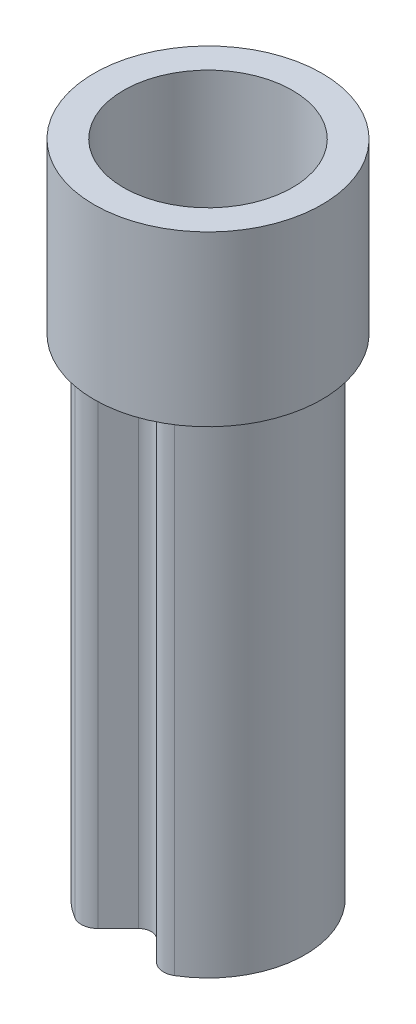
from build123d import *

# Parameters (mm, degrees)
BOSS_EXTRUDE1_DEPTH = 5.8
FILLET1_R           = 0.05
FILLET2_R           = 0.2
SKETCH2_R           = 1.35
SKETCH2_R_2         = 1
BOSS_EXTRUDE2_DEPTH = 2


with BuildPart() as part:
    # Sketch1 → Boss-Extrude1 (new body)
    with BuildSketch(Plane(origin=(0, 0, 0), x_dir=(1, 0, 0), z_dir=(0, 1, 0))):
        with BuildLine():
            Line((-0.448807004, -1.058807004), (-0.106066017, -0.716066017))
            ThreePointArc((-0.106066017, -0.716066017), (0, -0.672132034), (0.106066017, -0.716066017))
            Line((0.106066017, -0.716066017), (0.448807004, -1.058807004))
            ThreePointArc((0.448807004, -1.058807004), (0, 1.15), (-0.448807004, -1.058807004))
        make_face()
        with BuildLine():
            Line((-0.479612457, -0.877480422), (-0.212132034, -0.61))
            ThreePointArc((-0.212132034, -0.61), (0, -0.522132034), (0.212132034, -0.61))
            Line((0.212132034, -0.61), (0.479612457, -0.877480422))
            ThreePointArc((0.479612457, -0.877480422), (0, 1), (-0.479612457, -0.877480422))
        make_face(mode=Mode.SUBTRACT)
    extrude(amount=BOSS_EXTRUDE1_DEPTH)

    # Fillet1
    fillet1_edges = [part.edges().sort_by_distance(p)[0] for p in [
        (0.479612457, 2.9, 0.877480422),
        (-0.479612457, 2.9, 0.877480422),
    ]]
    fillet(fillet1_edges, radius=FILLET1_R)

    # Fillet2
    fillet2_edges = [part.edges().sort_by_distance(p)[0] for p in [
        (-0.448807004, 2.9, 1.058807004),
        (0.448807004, 2.9, 1.058807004),
    ]]
    fillet(fillet2_edges, radius=FILLET2_R)

    # Sketch2 → Boss-Extrude2 (add)
    with BuildSketch(Plane(origin=(0, 5.8, 0), x_dir=(1, 0, 0), z_dir=(0, 1, 0))):
        with Locations(Location((0, 0, 0), (0, 0, 90))):
            Circle(SKETCH2_R)
        with Locations(Location((0, 0, 0), (0, 0, 239.09383603))):
            Circle(SKETCH2_R_2, mode=Mode.SUBTRACT)
    extrude(amount=BOSS_EXTRUDE2_DEPTH)


solid = part.part
